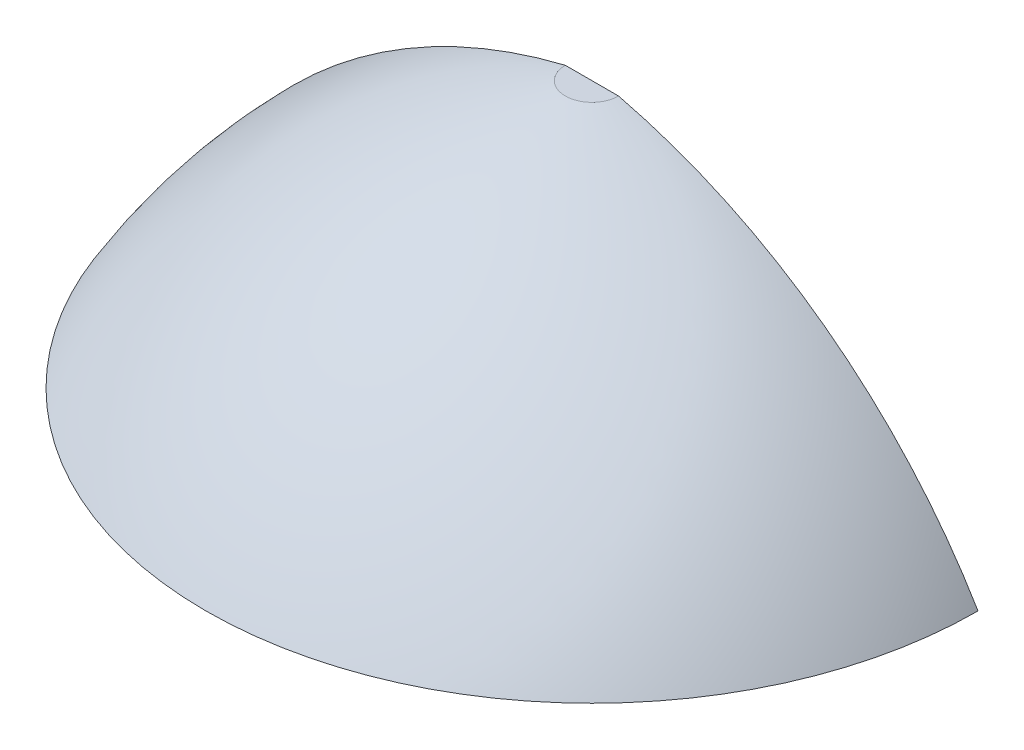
ISO-10303-21;
HEADER;
FILE_DESCRIPTION(('STEP AP214'),'2;1');
FILE_NAME('part.step','',(''),(''),'','','');
FILE_SCHEMA(('AUTOMOTIVE_DESIGN { 1 0 10303 214 1 1 1 1 }'));
ENDSEC;
DATA;
#1=APPLICATION_CONTEXT('core data for automotive mechanical design processes');
#2=APPLICATION_PROTOCOL_DEFINITION('international standard','automotive_design',2000,#1);
#3=PRODUCT_CONTEXT('',#1,'mechanical');
#4=PRODUCT('Part','Part','',(#3));
#5=PRODUCT_RELATED_PRODUCT_CATEGORY('part','',(#4));
#6=PRODUCT_DEFINITION_FORMATION('','',#4);
#7=PRODUCT_DEFINITION_CONTEXT('part definition',#1,'design');
#8=PRODUCT_DEFINITION('design','',#6,#7);
#9=PRODUCT_DEFINITION_SHAPE('','',#8);
#10=(LENGTH_UNIT() NAMED_UNIT(*) SI_UNIT(.MILLI.,.METRE.));
#11=(NAMED_UNIT(*) PLANE_ANGLE_UNIT() SI_UNIT($,.RADIAN.));
#12=(NAMED_UNIT(*) SI_UNIT($,.STERADIAN.) SOLID_ANGLE_UNIT());
#13=UNCERTAINTY_MEASURE_WITH_UNIT(LENGTH_MEASURE(1.E-05),#10,'distance_accuracy_value','');
#14=(GEOMETRIC_REPRESENTATION_CONTEXT(3) GLOBAL_UNCERTAINTY_ASSIGNED_CONTEXT((#13)) GLOBAL_UNIT_ASSIGNED_CONTEXT((#10,
#11,#12)) REPRESENTATION_CONTEXT('',''));
#15=CARTESIAN_POINT('',(0.,0.,0.));
#16=DIRECTION('',(0.,0.,1.));
#17=DIRECTION('',(1.,0.,0.));
#18=AXIS2_PLACEMENT_3D('',#15,#16,#17);
#19=CARTESIAN_POINT('',(0.,-6.94017974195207,0.));
#20=DIRECTION('',(0.,-1.,0.));
#21=DIRECTION('',(0.,0.,-1.));
#22=AXIS2_PLACEMENT_3D('',#19,#20,#21);
#23=PLANE('',#22);
#24=CARTESIAN_POINT('',(0.,-6.94017974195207,0.));
#25=DIRECTION('',(0.,1.,0.));
#26=DIRECTION('',(0.,0.,1.));
#27=AXIS2_PLACEMENT_3D('',#24,#25,#26);
#28=CIRCLE('',#27,0.254000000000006);
#29=CARTESIAN_POINT('',(-0.254000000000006,-6.94017974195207,0.));
#30=VERTEX_POINT('',#29);
#31=CARTESIAN_POINT('',(0.254000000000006,-6.94017974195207,0.));
#32=VERTEX_POINT('',#31);
#33=EDGE_CURVE('E11',#30,#32,#28,.T.);
#34=ORIENTED_EDGE('',*,*,#33,.T.);
#35=DIRECTION('',(1.,0.,0.));
#36=VECTOR('',#35,1.);
#37=CARTESIAN_POINT('',(0.,-6.94017974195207,0.));
#38=LINE('',#37,#36);
#39=EDGE_CURVE('E61',#30,#32,#38,.T.);
#40=ORIENTED_EDGE('',*,*,#39,.F.);
#41=EDGE_LOOP('',(#34,#40));
#42=FACE_BOUND('',#41,.T.);
#43=ADVANCED_FACE('F29',(#42),#23,.F.);
#44=CARTESIAN_POINT('',(0.,-12.2738717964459,0.));
#45=DIRECTION('',(0.,1.,0.));
#46=DIRECTION('',(0.,0.,1.));
#47=AXIS2_PLACEMENT_3D('',#44,#45,#46);
#48=DEGENERATE_TOROIDAL_SURFACE('',#47,1.04164226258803,5.48880313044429,.F.);
#49=CARTESIAN_POINT('',(0.,-9.48017974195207,0.));
#50=DIRECTION('',(0.,1.,0.));
#51=DIRECTION('',(0.,0.,1.));
#52=AXIS2_PLACEMENT_3D('',#49,#50,#51);
#53=CIRCLE('',#52,3.68300000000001);
#54=CARTESIAN_POINT('',(-3.68300000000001,-9.48017974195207,0.));
#55=VERTEX_POINT('',#54);
#56=CARTESIAN_POINT('',(3.68300000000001,-9.48017974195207,0.));
#57=VERTEX_POINT('',#56);
#58=EDGE_CURVE('E36',#55,#57,#53,.T.);
#59=ORIENTED_EDGE('',*,*,#58,.T.);
#60=CARTESIAN_POINT('',(-1.04164226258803,-12.2738717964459,0.));
#61=DIRECTION('',(0.,0.,1.));
#62=DIRECTION('',(-1.,0.,0.));
#63=AXIS2_PLACEMENT_3D('',#60,#61,#62);
#64=CIRCLE('',#63,5.48880313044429);
#65=EDGE_CURVE('E58',#57,#32,#64,.T.);
#66=ORIENTED_EDGE('',*,*,#65,.T.);
#67=ORIENTED_EDGE('',*,*,#33,.F.);
#68=CARTESIAN_POINT('',(1.04164226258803,-12.2738717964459,0.));
#69=DIRECTION('',(0.,0.,-1.));
#70=DIRECTION('',(1.,0.,0.));
#71=AXIS2_PLACEMENT_3D('',#68,#69,#70);
#72=CIRCLE('',#71,5.48880313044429);
#73=EDGE_CURVE('E57',#55,#30,#72,.T.);
#74=ORIENTED_EDGE('',*,*,#73,.F.);
#75=EDGE_LOOP('',(#59,#66,#67,#74));
#76=FACE_BOUND('',#75,.T.);
#77=ADVANCED_FACE('F60',(#76),#48,.F.);
#78=CARTESIAN_POINT('',(0.,-9.48017974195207,0.));
#79=DIRECTION('',(0.,1.,0.));
#80=DIRECTION('',(0.,0.,1.));
#81=AXIS2_PLACEMENT_3D('',#78,#79,#80);
#82=PLANE('',#81);
#83=DIRECTION('',(-1.,0.,0.));
#84=VECTOR('',#83,1.);
#85=CARTESIAN_POINT('',(0.,-9.48017974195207,0.));
#86=LINE('',#85,#84);
#87=EDGE_CURVE('E53',#57,#55,#86,.T.);
#88=ORIENTED_EDGE('',*,*,#87,.F.);
#89=ORIENTED_EDGE('',*,*,#58,.F.);
#90=EDGE_LOOP('',(#88,#89));
#91=FACE_BOUND('',#90,.T.);
#92=ADVANCED_FACE('F54',(#91),#82,.F.);
#93=CARTESIAN_POINT('',(1.04164226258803,-12.2738717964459,0.));
#94=DIRECTION('',(0.,0.,1.));
#95=DIRECTION('',(1.,0.,0.));
#96=AXIS2_PLACEMENT_3D('',#93,#94,#95);
#97=PLANE('',#96);
#98=ORIENTED_EDGE('',*,*,#39,.T.);
#99=ORIENTED_EDGE('',*,*,#65,.F.);
#100=ORIENTED_EDGE('',*,*,#87,.T.);
#101=ORIENTED_EDGE('',*,*,#73,.T.);
#102=EDGE_LOOP('',(#98,#99,#100,#101));
#103=FACE_BOUND('',#102,.T.);
#104=ADVANCED_FACE('F62',(#103),#97,.F.);
#105=CLOSED_SHELL('',(#43,#77,#92,#104));
#106=MANIFOLD_SOLID_BREP('B2',#105);
#107=ADVANCED_BREP_SHAPE_REPRESENTATION('',(#18,#106),#14);
#108=SHAPE_DEFINITION_REPRESENTATION(#9,#107);
ENDSEC;
END-ISO-10303-21;
